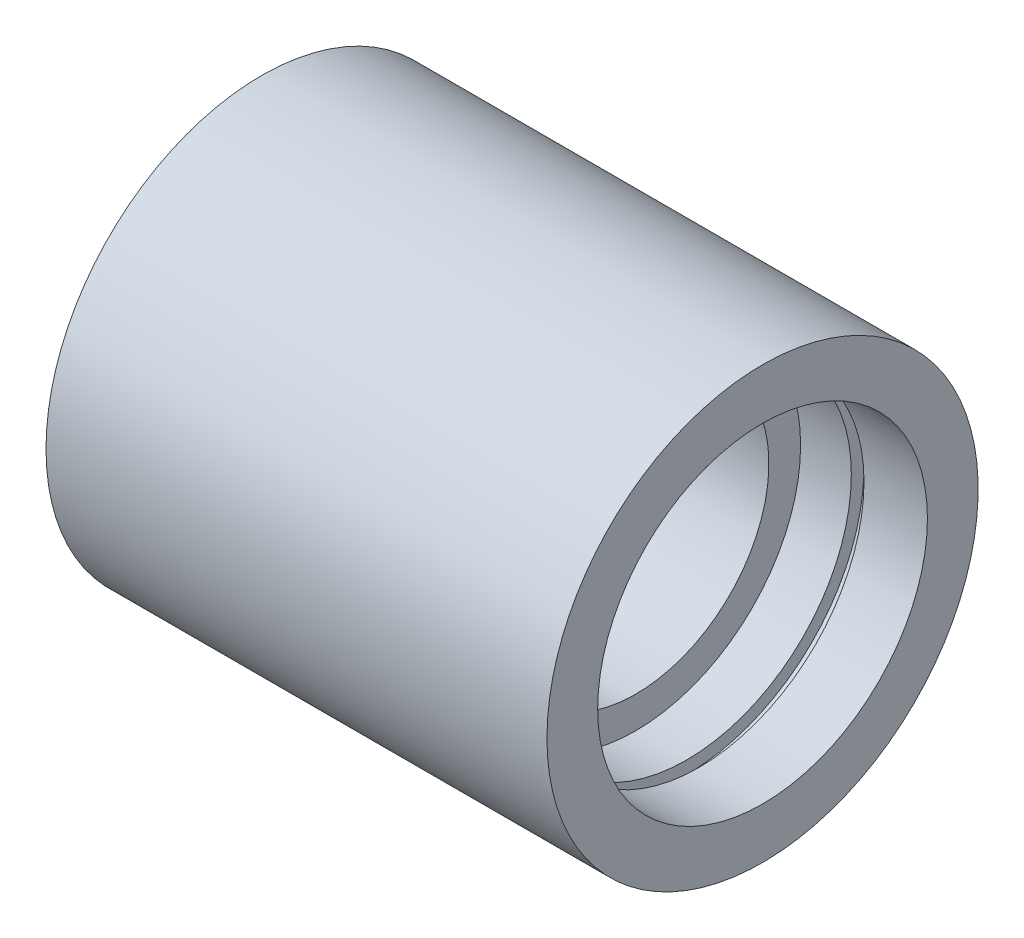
from build123d import *


with BuildPart() as part:
    # Esquisse1 → Base-R_volution (revolve)
    with BuildSketch(Plane.XY, mode=Mode.PRIVATE) as base_r_volution_sk:
        Polygon((0, 13), (0, 17), (39.5, 17), (39.5, 13), (34.5, 13), (34.5, 14), (33.5, 14), (33.5, 13), (29.5, 13), (29.5, 10.5), (15, 10.5), (15, 4), (10, 4), (10, 13), align=None)
    revolve(base_r_volution_sk.sketch.rotate(Axis((0, 0, 0), (1, 0, 0)), 90), axis=Axis((0, 0, 0), (1, 0, 0)))


solid = part.part
